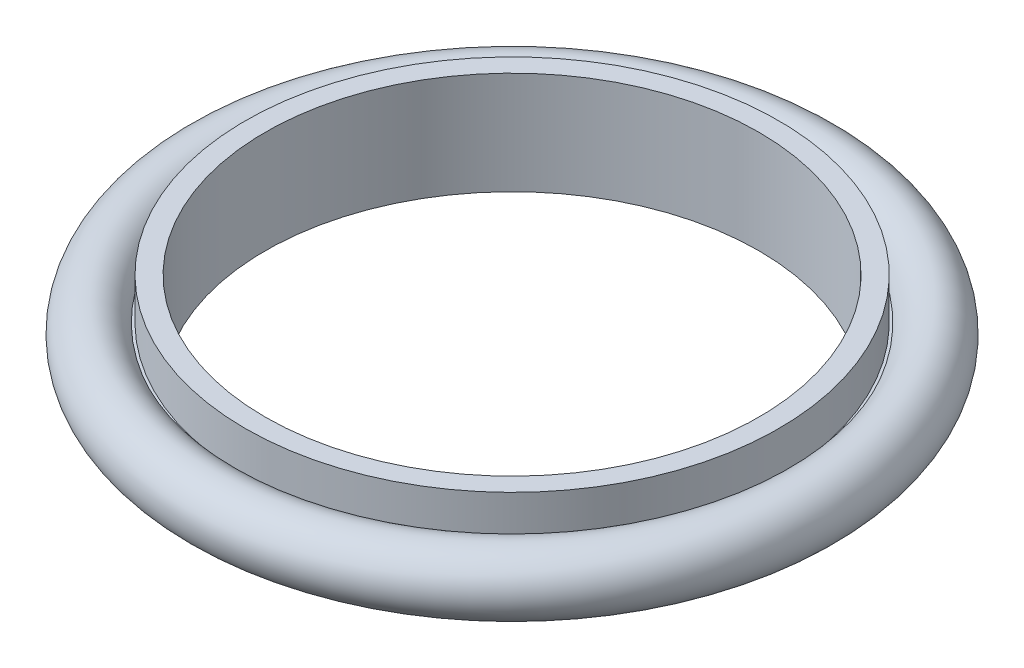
from build123d import *


with BuildPart() as part:
    # Sketch1 → Revolve1 (revolve)
    with BuildSketch(Plane(origin=(0, 0, 0), x_dir=(0, 0, -1), z_dir=(1, 0, 0)), mode=Mode.PRIVATE) as revolve1_sk:
        with BuildLine():
            Line((20.447, 3.379401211), (20.447, 0))
            Line((20.447, 0), (18.923, 0))
            Line((18.923, 0), (18.923, 7.874))
            Line((18.923, 7.874), (20.447, 7.874))
            Line((20.447, 7.874), (20.447, 4.687319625))
            Line((20.447, 4.687319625), (20.644842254, 4.687319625))
            ThreePointArc((20.644842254, 4.687319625), (25.270883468, 3.836757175), (20.589586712, 3.379401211))
            Line((20.589586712, 3.379401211), (20.447, 3.379401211))
        make_face()
    revolve(revolve1_sk.sketch.rotate(Axis((0, 0, 0), (0, -1, 0)), 180), axis=Axis((0, 0, 0), (0, -1, 0)))


solid = part.part
